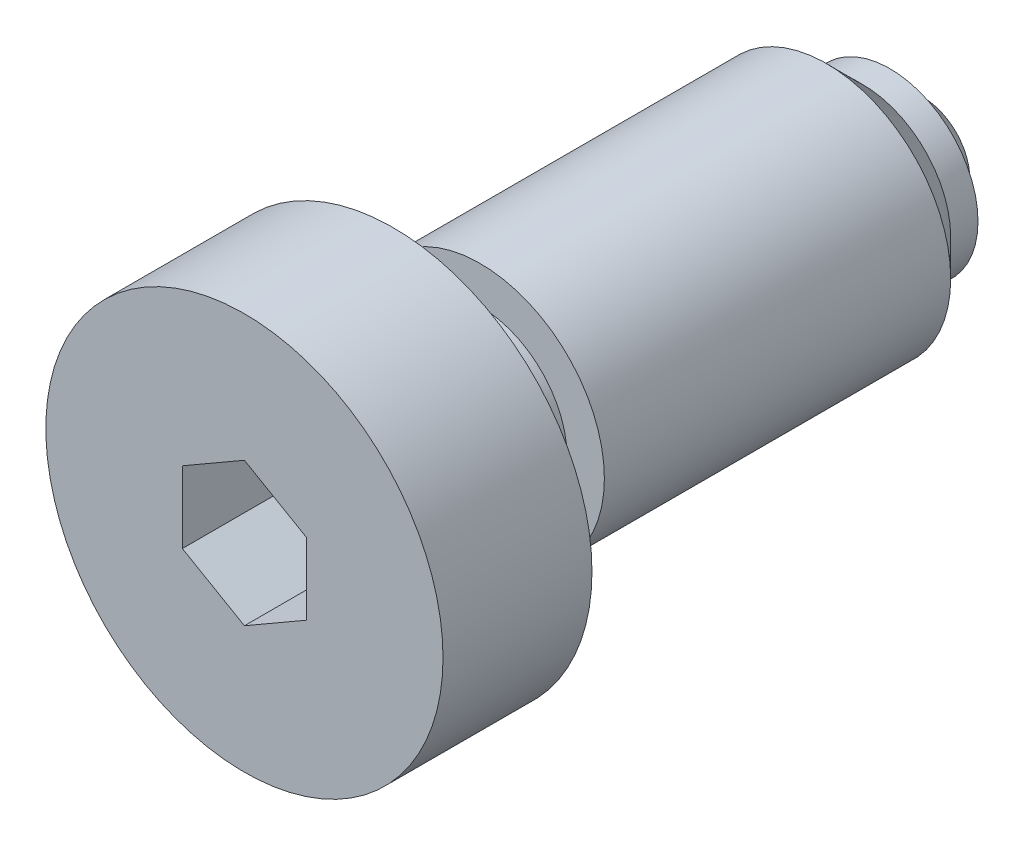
ISO-10303-21;
HEADER;
FILE_DESCRIPTION(('STEP AP214'),'2;1');
FILE_NAME('part.step','',(''),(''),'','','');
FILE_SCHEMA(('AUTOMOTIVE_DESIGN { 1 0 10303 214 1 1 1 1 }'));
ENDSEC;
DATA;
#1=APPLICATION_CONTEXT('core data for automotive mechanical design processes');
#2=APPLICATION_PROTOCOL_DEFINITION('international standard','automotive_design',2000,#1);
#3=PRODUCT_CONTEXT('',#1,'mechanical');
#4=PRODUCT('Part','Part','',(#3));
#5=PRODUCT_RELATED_PRODUCT_CATEGORY('part','',(#4));
#6=PRODUCT_DEFINITION_FORMATION('','',#4);
#7=PRODUCT_DEFINITION_CONTEXT('part definition',#1,'design');
#8=PRODUCT_DEFINITION('design','',#6,#7);
#9=PRODUCT_DEFINITION_SHAPE('','',#8);
#10=(LENGTH_UNIT() NAMED_UNIT(*) SI_UNIT(.MILLI.,.METRE.));
#11=(NAMED_UNIT(*) PLANE_ANGLE_UNIT() SI_UNIT($,.RADIAN.));
#12=(NAMED_UNIT(*) SI_UNIT($,.STERADIAN.) SOLID_ANGLE_UNIT());
#13=UNCERTAINTY_MEASURE_WITH_UNIT(LENGTH_MEASURE(1.E-05),#10,'distance_accuracy_value','');
#14=(GEOMETRIC_REPRESENTATION_CONTEXT(3) GLOBAL_UNCERTAINTY_ASSIGNED_CONTEXT((#13)) GLOBAL_UNIT_ASSIGNED_CONTEXT((#10,
#11,#12)) REPRESENTATION_CONTEXT('',''));
#15=CARTESIAN_POINT('',(0.,0.,0.));
#16=DIRECTION('',(0.,0.,1.));
#17=DIRECTION('',(1.,0.,0.));
#18=AXIS2_PLACEMENT_3D('',#15,#16,#17);
#19=CARTESIAN_POINT('',(0.,0.,24.0318271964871));
#20=DIRECTION('',(0.,0.,1.));
#21=DIRECTION('',(1.,0.,0.));
#22=AXIS2_PLACEMENT_3D('',#19,#20,#21);
#23=CYLINDRICAL_SURFACE('',#22,8.);
#24=CARTESIAN_POINT('',(0.,0.,22.));
#25=DIRECTION('',(0.,0.,1.));
#26=DIRECTION('',(1.,0.,0.));
#27=AXIS2_PLACEMENT_3D('',#24,#25,#26);
#28=CIRCLE('',#27,8.);
#29=CARTESIAN_POINT('',(8.,0.,22.));
#30=VERTEX_POINT('',#29);
#31=EDGE_CURVE('E9',#30,#30,#28,.T.);
#32=ORIENTED_EDGE('',*,*,#31,.T.);
#33=EDGE_LOOP('',(#32));
#34=FACE_BOUND('',#33,.T.);
#35=CARTESIAN_POINT('',(0.,0.,28.));
#36=DIRECTION('',(0.,0.,1.));
#37=DIRECTION('',(1.,0.,0.));
#38=AXIS2_PLACEMENT_3D('',#35,#36,#37);
#39=CIRCLE('',#38,8.);
#40=CARTESIAN_POINT('',(8.,0.,28.));
#41=VERTEX_POINT('',#40);
#42=EDGE_CURVE('E116',#41,#41,#39,.T.);
#43=ORIENTED_EDGE('',*,*,#42,.F.);
#44=EDGE_LOOP('',(#43));
#45=FACE_BOUND('',#44,.T.);
#46=ADVANCED_FACE('F14',(#34,#45),#23,.T.);
#47=CARTESIAN_POINT('',(3.5,0.,22.));
#48=DIRECTION('',(0.,0.,-1.));
#49=DIRECTION('',(-1.,0.,0.));
#50=AXIS2_PLACEMENT_3D('',#47,#48,#49);
#51=PLANE('',#50);
#52=CARTESIAN_POINT('',(0.,0.,22.));
#53=DIRECTION('',(0.,0.,1.));
#54=DIRECTION('',(1.,0.,0.));
#55=AXIS2_PLACEMENT_3D('',#52,#53,#54);
#56=CIRCLE('',#55,3.5);
#57=CARTESIAN_POINT('',(3.5,0.,22.));
#58=VERTEX_POINT('',#57);
#59=EDGE_CURVE('E21',#58,#58,#56,.T.);
#60=ORIENTED_EDGE('',*,*,#59,.T.);
#61=EDGE_LOOP('',(#60));
#62=FACE_BOUND('',#61,.T.);
#63=ORIENTED_EDGE('',*,*,#31,.F.);
#64=EDGE_LOOP('',(#63));
#65=FACE_BOUND('',#64,.T.);
#66=ADVANCED_FACE('F145',(#62,#65),#51,.T.);
#67=CARTESIAN_POINT('',(0.,0.,24.0318271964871));
#68=DIRECTION('',(0.,0.,1.));
#69=DIRECTION('',(1.,0.,0.));
#70=AXIS2_PLACEMENT_3D('',#67,#68,#69);
#71=CYLINDRICAL_SURFACE('',#70,3.5);
#72=CARTESIAN_POINT('',(0.,0.,18.5));
#73=DIRECTION('',(0.,0.,1.));
#74=DIRECTION('',(1.,0.,0.));
#75=AXIS2_PLACEMENT_3D('',#72,#73,#74);
#76=CIRCLE('',#75,3.5);
#77=CARTESIAN_POINT('',(3.5,0.,18.5));
#78=VERTEX_POINT('',#77);
#79=EDGE_CURVE('E140',#78,#78,#76,.T.);
#80=ORIENTED_EDGE('',*,*,#79,.T.);
#81=EDGE_LOOP('',(#80));
#82=FACE_BOUND('',#81,.T.);
#83=ORIENTED_EDGE('',*,*,#59,.F.);
#84=EDGE_LOOP('',(#83));
#85=FACE_BOUND('',#84,.T.);
#86=ADVANCED_FACE('F148',(#82,#85),#71,.T.);
#87=CARTESIAN_POINT('',(3.5,0.,18.5));
#88=DIRECTION('',(0.,0.,1.));
#89=DIRECTION('',(1.,0.,0.));
#90=AXIS2_PLACEMENT_3D('',#87,#88,#89);
#91=PLANE('',#90);
#92=CARTESIAN_POINT('',(0.,0.,18.5));
#93=DIRECTION('',(0.,0.,1.));
#94=DIRECTION('',(1.,0.,0.));
#95=AXIS2_PLACEMENT_3D('',#92,#93,#94);
#96=CIRCLE('',#95,5.);
#97=CARTESIAN_POINT('',(5.,0.,18.5));
#98=VERTEX_POINT('',#97);
#99=EDGE_CURVE('E137',#98,#98,#96,.T.);
#100=ORIENTED_EDGE('',*,*,#99,.T.);
#101=EDGE_LOOP('',(#100));
#102=FACE_BOUND('',#101,.T.);
#103=ORIENTED_EDGE('',*,*,#79,.F.);
#104=EDGE_LOOP('',(#103));
#105=FACE_BOUND('',#104,.T.);
#106=ADVANCED_FACE('F150',(#102,#105),#91,.T.);
#107=CARTESIAN_POINT('',(0.,0.,24.0318271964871));
#108=DIRECTION('',(0.,0.,1.));
#109=DIRECTION('',(1.,0.,0.));
#110=AXIS2_PLACEMENT_3D('',#107,#108,#109);
#111=CYLINDRICAL_SURFACE('',#110,5.);
#112=CARTESIAN_POINT('',(0.,0.,4.55));
#113=DIRECTION('',(0.,0.,1.));
#114=DIRECTION('',(1.,0.,0.));
#115=AXIS2_PLACEMENT_3D('',#112,#113,#114);
#116=CIRCLE('',#115,5.);
#117=CARTESIAN_POINT('',(5.,0.,4.55));
#118=VERTEX_POINT('',#117);
#119=EDGE_CURVE('E134',#118,#118,#116,.T.);
#120=ORIENTED_EDGE('',*,*,#119,.T.);
#121=EDGE_LOOP('',(#120));
#122=FACE_BOUND('',#121,.T.);
#123=ORIENTED_EDGE('',*,*,#99,.F.);
#124=EDGE_LOOP('',(#123));
#125=FACE_BOUND('',#124,.T.);
#126=ADVANCED_FACE('F158',(#122,#125),#111,.T.);
#127=CARTESIAN_POINT('',(0.,0.,4.55));
#128=DIRECTION('',(0.,0.,1.));
#129=DIRECTION('',(1.,0.,0.));
#130=AXIS2_PLACEMENT_3D('',#127,#128,#129);
#131=CONICAL_SURFACE('',#130,5.,0.78539816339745);
#132=CARTESIAN_POINT('',(0.,0.,3.1));
#133=DIRECTION('',(0.,0.,1.));
#134=DIRECTION('',(1.,0.,0.));
#135=AXIS2_PLACEMENT_3D('',#132,#133,#134);
#136=CIRCLE('',#135,3.55);
#137=CARTESIAN_POINT('',(3.55,0.,3.1));
#138=VERTEX_POINT('',#137);
#139=EDGE_CURVE('E131',#138,#138,#136,.T.);
#140=ORIENTED_EDGE('',*,*,#139,.T.);
#141=EDGE_LOOP('',(#140));
#142=FACE_BOUND('',#141,.T.);
#143=ORIENTED_EDGE('',*,*,#119,.F.);
#144=EDGE_LOOP('',(#143));
#145=FACE_BOUND('',#144,.T.);
#146=ADVANCED_FACE('F189',(#142,#145),#131,.T.);
#147=CARTESIAN_POINT('',(0.,0.,24.0318271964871));
#148=DIRECTION('',(0.,0.,1.));
#149=DIRECTION('',(1.,0.,0.));
#150=AXIS2_PLACEMENT_3D('',#147,#148,#149);
#151=CYLINDRICAL_SURFACE('',#150,3.55);
#152=CARTESIAN_POINT('',(0.,0.,2.));
#153=DIRECTION('',(0.,0.,1.));
#154=DIRECTION('',(1.,0.,0.));
#155=AXIS2_PLACEMENT_3D('',#152,#153,#154);
#156=CIRCLE('',#155,3.55);
#157=CARTESIAN_POINT('',(3.55,0.,2.));
#158=VERTEX_POINT('',#157);
#159=EDGE_CURVE('E128',#158,#158,#156,.T.);
#160=ORIENTED_EDGE('',*,*,#159,.T.);
#161=EDGE_LOOP('',(#160));
#162=FACE_BOUND('',#161,.T.);
#163=ORIENTED_EDGE('',*,*,#139,.F.);
#164=EDGE_LOOP('',(#163));
#165=FACE_BOUND('',#164,.T.);
#166=ADVANCED_FACE('F185',(#162,#165),#151,.T.);
#167=CARTESIAN_POINT('',(3.55,0.,2.));
#168=DIRECTION('',(0.,0.,-1.));
#169=DIRECTION('',(-1.,0.,0.));
#170=AXIS2_PLACEMENT_3D('',#167,#168,#169);
#171=PLANE('',#170);
#172=CARTESIAN_POINT('',(0.,0.,2.));
#173=DIRECTION('',(0.,0.,1.));
#174=DIRECTION('',(1.,0.,0.));
#175=AXIS2_PLACEMENT_3D('',#172,#173,#174);
#176=CIRCLE('',#175,2.82842712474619);
#177=CARTESIAN_POINT('',(2.82842712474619,0.,2.));
#178=VERTEX_POINT('',#177);
#179=EDGE_CURVE('E125',#178,#178,#176,.T.);
#180=ORIENTED_EDGE('',*,*,#179,.T.);
#181=EDGE_LOOP('',(#180));
#182=FACE_BOUND('',#181,.T.);
#183=ORIENTED_EDGE('',*,*,#159,.F.);
#184=EDGE_LOOP('',(#183));
#185=FACE_BOUND('',#184,.T.);
#186=ADVANCED_FACE('F178',(#182,#185),#171,.T.);
#187=CARTESIAN_POINT('',(0.,0.,3.));
#188=DIRECTION('',(0.,0.,1.));
#189=DIRECTION('',(1.,0.,0.));
#190=AXIS2_PLACEMENT_3D('',#187,#188,#189);
#191=SPHERICAL_SURFACE('',#190,3.);
#192=ORIENTED_EDGE('',*,*,#179,.F.);
#193=EDGE_LOOP('',(#192));
#194=FACE_BOUND('',#193,.T.);
#195=ADVANCED_FACE('F170',(#194),#191,.T.);
#196=CARTESIAN_POINT('',(8.,0.,28.));
#197=DIRECTION('',(0.,0.,1.));
#198=DIRECTION('',(1.,0.,0.));
#199=AXIS2_PLACEMENT_3D('',#196,#197,#198);
#200=PLANE('',#199);
#201=DIRECTION('',(-0.866025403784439,0.5,0.));
#202=VECTOR('',#201,1.);
#203=CARTESIAN_POINT('',(2.5,1.44337567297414,28.));
#204=LINE('',#203,#202);
#205=CARTESIAN_POINT('',(2.5,1.44337567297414,28.));
#206=VERTEX_POINT('',#205);
#207=CARTESIAN_POINT('',(0.,2.88675134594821,28.));
#208=VERTEX_POINT('',#207);
#209=EDGE_CURVE('E28',#206,#208,#204,.T.);
#210=ORIENTED_EDGE('',*,*,#209,.F.);
#211=DIRECTION('',(0.,1.,0.));
#212=VECTOR('',#211,1.);
#213=CARTESIAN_POINT('',(2.5,-1.44337567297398,28.));
#214=LINE('',#213,#212);
#215=CARTESIAN_POINT('',(2.5,-1.44337567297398,28.));
#216=VERTEX_POINT('',#215);
#217=EDGE_CURVE('E98',#216,#206,#214,.T.);
#218=ORIENTED_EDGE('',*,*,#217,.F.);
#219=DIRECTION('',(0.866025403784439,0.5,0.));
#220=VECTOR('',#219,1.);
#221=CARTESIAN_POINT('',(0.,-2.88675134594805,28.));
#222=LINE('',#221,#220);
#223=CARTESIAN_POINT('',(0.,-2.88675134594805,28.));
#224=VERTEX_POINT('',#223);
#225=EDGE_CURVE('E92',#224,#216,#222,.T.);
#226=ORIENTED_EDGE('',*,*,#225,.F.);
#227=DIRECTION('',(0.866025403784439,-0.5,0.));
#228=VECTOR('',#227,1.);
#229=CARTESIAN_POINT('',(-2.5,-1.44337567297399,28.));
#230=LINE('',#229,#228);
#231=CARTESIAN_POINT('',(-2.5,-1.44337567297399,28.));
#232=VERTEX_POINT('',#231);
#233=EDGE_CURVE('E90',#232,#224,#230,.T.);
#234=ORIENTED_EDGE('',*,*,#233,.F.);
#235=DIRECTION('',(0.,-1.,0.));
#236=VECTOR('',#235,1.);
#237=CARTESIAN_POINT('',(-2.5,1.44337567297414,28.));
#238=LINE('',#237,#236);
#239=CARTESIAN_POINT('',(-2.5,1.44337567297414,28.));
#240=VERTEX_POINT('',#239);
#241=EDGE_CURVE('E71',#240,#232,#238,.T.);
#242=ORIENTED_EDGE('',*,*,#241,.F.);
#243=DIRECTION('',(-0.866025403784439,-0.5,0.));
#244=VECTOR('',#243,1.);
#245=CARTESIAN_POINT('',(0.,2.88675134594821,28.));
#246=LINE('',#245,#244);
#247=EDGE_CURVE('E82',#208,#240,#246,.T.);
#248=ORIENTED_EDGE('',*,*,#247,.F.);
#249=EDGE_LOOP('',(#210,#218,#226,#234,#242,#248));
#250=FACE_BOUND('',#249,.T.);
#251=ORIENTED_EDGE('',*,*,#42,.T.);
#252=EDGE_LOOP('',(#251));
#253=FACE_BOUND('',#252,.T.);
#254=ADVANCED_FACE('F86',(#250,#253),#200,.T.);
#255=CARTESIAN_POINT('',(2.5,1.44337567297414,24.));
#256=DIRECTION('',(0.5,0.866025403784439,0.));
#257=DIRECTION('',(0.866025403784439,-0.5,0.));
#258=AXIS2_PLACEMENT_3D('',#255,#256,#257);
#259=PLANE('',#258);
#260=ORIENTED_EDGE('',*,*,#209,.T.);
#261=DIRECTION('',(0.,0.,1.));
#262=VECTOR('',#261,1.);
#263=CARTESIAN_POINT('',(0.,2.88675134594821,24.));
#264=LINE('',#263,#262);
#265=CARTESIAN_POINT('',(0.,2.88675134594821,24.));
#266=VERTEX_POINT('',#265);
#267=EDGE_CURVE('E79',#266,#208,#264,.T.);
#268=ORIENTED_EDGE('',*,*,#267,.F.);
#269=DIRECTION('',(-0.866025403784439,0.5,0.));
#270=VECTOR('',#269,1.);
#271=CARTESIAN_POINT('',(2.5,1.44337567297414,24.));
#272=LINE('',#271,#270);
#273=CARTESIAN_POINT('',(2.5,1.44337567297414,24.));
#274=VERTEX_POINT('',#273);
#275=EDGE_CURVE('E100',#274,#266,#272,.T.);
#276=ORIENTED_EDGE('',*,*,#275,.F.);
#277=DIRECTION('',(0.,0.,1.));
#278=VECTOR('',#277,1.);
#279=CARTESIAN_POINT('',(2.5,1.44337567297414,24.));
#280=LINE('',#279,#278);
#281=EDGE_CURVE('E35',#274,#206,#280,.T.);
#282=ORIENTED_EDGE('',*,*,#281,.T.);
#283=EDGE_LOOP('',(#260,#268,#276,#282));
#284=FACE_BOUND('',#283,.T.);
#285=ADVANCED_FACE('F169',(#284),#259,.F.);
#286=CARTESIAN_POINT('',(2.5,-1.44337567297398,24.));
#287=DIRECTION('',(1.,0.,0.));
#288=DIRECTION('',(0.,-1.,0.));
#289=AXIS2_PLACEMENT_3D('',#286,#287,#288);
#290=PLANE('',#289);
#291=ORIENTED_EDGE('',*,*,#217,.T.);
#292=ORIENTED_EDGE('',*,*,#281,.F.);
#293=DIRECTION('',(0.,1.,0.));
#294=VECTOR('',#293,1.);
#295=CARTESIAN_POINT('',(2.5,-1.44337567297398,24.));
#296=LINE('',#295,#294);
#297=CARTESIAN_POINT('',(2.5,-1.44337567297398,24.));
#298=VERTEX_POINT('',#297);
#299=EDGE_CURVE('E112',#298,#274,#296,.T.);
#300=ORIENTED_EDGE('',*,*,#299,.F.);
#301=DIRECTION('',(0.,0.,1.));
#302=VECTOR('',#301,1.);
#303=CARTESIAN_POINT('',(2.5,-1.44337567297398,24.));
#304=LINE('',#303,#302);
#305=EDGE_CURVE('E117',#298,#216,#304,.T.);
#306=ORIENTED_EDGE('',*,*,#305,.T.);
#307=EDGE_LOOP('',(#291,#292,#300,#306));
#308=FACE_BOUND('',#307,.T.);
#309=ADVANCED_FACE('F176',(#308),#290,.F.);
#310=CARTESIAN_POINT('',(0.,-2.88675134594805,24.));
#311=DIRECTION('',(0.5,-0.866025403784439,0.));
#312=DIRECTION('',(-0.866025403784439,-0.5,0.));
#313=AXIS2_PLACEMENT_3D('',#310,#311,#312);
#314=PLANE('',#313);
#315=ORIENTED_EDGE('',*,*,#225,.T.);
#316=ORIENTED_EDGE('',*,*,#305,.F.);
#317=DIRECTION('',(0.866025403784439,0.5,0.));
#318=VECTOR('',#317,1.);
#319=CARTESIAN_POINT('',(0.,-2.88675134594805,24.));
#320=LINE('',#319,#318);
#321=CARTESIAN_POINT('',(0.,-2.88675134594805,24.));
#322=VERTEX_POINT('',#321);
#323=EDGE_CURVE('E109',#322,#298,#320,.T.);
#324=ORIENTED_EDGE('',*,*,#323,.F.);
#325=DIRECTION('',(0.,0.,1.));
#326=VECTOR('',#325,1.);
#327=CARTESIAN_POINT('',(0.,-2.88675134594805,24.));
#328=LINE('',#327,#326);
#329=EDGE_CURVE('E119',#322,#224,#328,.T.);
#330=ORIENTED_EDGE('',*,*,#329,.T.);
#331=EDGE_LOOP('',(#315,#316,#324,#330));
#332=FACE_BOUND('',#331,.T.);
#333=ADVANCED_FACE('F252',(#332),#314,.F.);
#334=CARTESIAN_POINT('',(-2.5,-1.44337567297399,24.));
#335=DIRECTION('',(-0.5,-0.866025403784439,0.));
#336=DIRECTION('',(-0.866025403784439,0.5,0.));
#337=AXIS2_PLACEMENT_3D('',#334,#335,#336);
#338=PLANE('',#337);
#339=ORIENTED_EDGE('',*,*,#233,.T.);
#340=ORIENTED_EDGE('',*,*,#329,.F.);
#341=DIRECTION('',(0.866025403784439,-0.5,0.));
#342=VECTOR('',#341,1.);
#343=CARTESIAN_POINT('',(-2.5,-1.44337567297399,24.));
#344=LINE('',#343,#342);
#345=CARTESIAN_POINT('',(-2.5,-1.44337567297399,24.));
#346=VERTEX_POINT('',#345);
#347=EDGE_CURVE('E106',#346,#322,#344,.T.);
#348=ORIENTED_EDGE('',*,*,#347,.F.);
#349=DIRECTION('',(0.,0.,1.));
#350=VECTOR('',#349,1.);
#351=CARTESIAN_POINT('',(-2.5,-1.44337567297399,24.));
#352=LINE('',#351,#350);
#353=EDGE_CURVE('E78',#346,#232,#352,.T.);
#354=ORIENTED_EDGE('',*,*,#353,.T.);
#355=EDGE_LOOP('',(#339,#340,#348,#354));
#356=FACE_BOUND('',#355,.T.);
#357=ADVANCED_FACE('F261',(#356),#338,.F.);
#358=CARTESIAN_POINT('',(-2.5,1.44337567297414,24.));
#359=DIRECTION('',(-1.,0.,0.));
#360=DIRECTION('',(0.,1.,0.));
#361=AXIS2_PLACEMENT_3D('',#358,#359,#360);
#362=PLANE('',#361);
#363=ORIENTED_EDGE('',*,*,#241,.T.);
#364=ORIENTED_EDGE('',*,*,#353,.F.);
#365=DIRECTION('',(0.,-1.,0.));
#366=VECTOR('',#365,1.);
#367=CARTESIAN_POINT('',(-2.5,1.44337567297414,24.));
#368=LINE('',#367,#366);
#369=CARTESIAN_POINT('',(-2.5,1.44337567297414,24.));
#370=VERTEX_POINT('',#369);
#371=EDGE_CURVE('E74',#370,#346,#368,.T.);
#372=ORIENTED_EDGE('',*,*,#371,.F.);
#373=DIRECTION('',(0.,0.,1.));
#374=VECTOR('',#373,1.);
#375=CARTESIAN_POINT('',(-2.5,1.44337567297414,24.));
#376=LINE('',#375,#374);
#377=EDGE_CURVE('E67',#370,#240,#376,.T.);
#378=ORIENTED_EDGE('',*,*,#377,.T.);
#379=EDGE_LOOP('',(#363,#364,#372,#378));
#380=FACE_BOUND('',#379,.T.);
#381=ADVANCED_FACE('F69',(#380),#362,.F.);
#382=CARTESIAN_POINT('',(0.,2.88675134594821,24.));
#383=DIRECTION('',(-0.5,0.866025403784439,0.));
#384=DIRECTION('',(0.866025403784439,0.5,0.));
#385=AXIS2_PLACEMENT_3D('',#382,#383,#384);
#386=PLANE('',#385);
#387=ORIENTED_EDGE('',*,*,#247,.T.);
#388=ORIENTED_EDGE('',*,*,#377,.F.);
#389=DIRECTION('',(-0.866025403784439,-0.5,0.));
#390=VECTOR('',#389,1.);
#391=CARTESIAN_POINT('',(0.,2.88675134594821,24.));
#392=LINE('',#391,#390);
#393=EDGE_CURVE('E103',#266,#370,#392,.T.);
#394=ORIENTED_EDGE('',*,*,#393,.F.);
#395=ORIENTED_EDGE('',*,*,#267,.T.);
#396=EDGE_LOOP('',(#387,#388,#394,#395));
#397=FACE_BOUND('',#396,.T.);
#398=ADVANCED_FACE('F83',(#397),#386,.F.);
#399=CARTESIAN_POINT('',(-2.5,4.33012701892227,24.));
#400=DIRECTION('',(0.,0.,1.));
#401=DIRECTION('',(0.,-1.,0.));
#402=AXIS2_PLACEMENT_3D('',#399,#400,#401);
#403=PLANE('',#402);
#404=ORIENTED_EDGE('',*,*,#275,.T.);
#405=ORIENTED_EDGE('',*,*,#393,.T.);
#406=ORIENTED_EDGE('',*,*,#371,.T.);
#407=ORIENTED_EDGE('',*,*,#347,.T.);
#408=ORIENTED_EDGE('',*,*,#323,.T.);
#409=ORIENTED_EDGE('',*,*,#299,.T.);
#410=EDGE_LOOP('',(#404,#405,#406,#407,#408,#409));
#411=FACE_BOUND('',#410,.T.);
#412=ADVANCED_FACE('F288',(#411),#403,.T.);
#413=CLOSED_SHELL('',(#46,#66,#86,#106,#126,#146,#166,#186,#195,#254,#285,#309,#333,#357,#381,
#398,#412));
#414=MANIFOLD_SOLID_BREP('B1',#413);
#415=ADVANCED_BREP_SHAPE_REPRESENTATION('',(#18,#414),#14);
#416=SHAPE_DEFINITION_REPRESENTATION(#9,#415);
ENDSEC;
END-ISO-10303-21;
